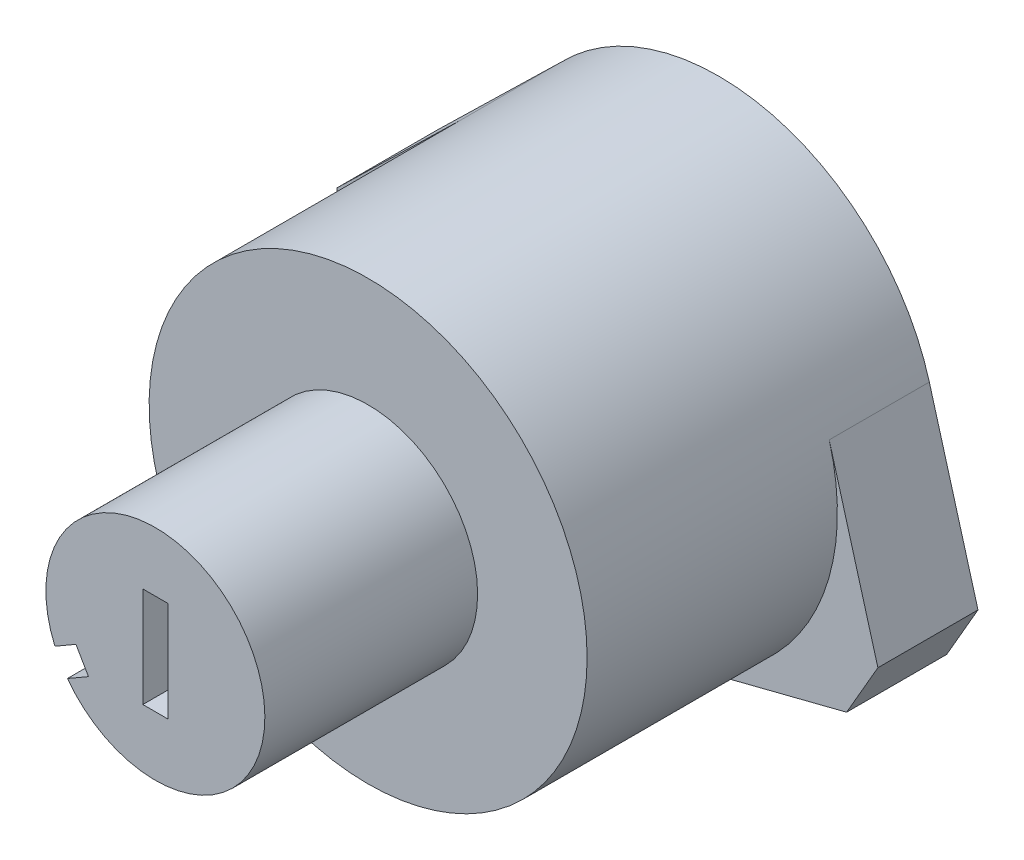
ISO-10303-21;
HEADER;
FILE_DESCRIPTION(('STEP AP214'),'2;1');
FILE_NAME('part.step','',(''),(''),'','','');
FILE_SCHEMA(('AUTOMOTIVE_DESIGN { 1 0 10303 214 1 1 1 1 }'));
ENDSEC;
DATA;
#1=APPLICATION_CONTEXT('core data for automotive mechanical design processes');
#2=APPLICATION_PROTOCOL_DEFINITION('international standard','automotive_design',2000,#1);
#3=PRODUCT_CONTEXT('',#1,'mechanical');
#4=PRODUCT('Part','Part','',(#3));
#5=PRODUCT_RELATED_PRODUCT_CATEGORY('part','',(#4));
#6=PRODUCT_DEFINITION_FORMATION('','',#4);
#7=PRODUCT_DEFINITION_CONTEXT('part definition',#1,'design');
#8=PRODUCT_DEFINITION('design','',#6,#7);
#9=PRODUCT_DEFINITION_SHAPE('','',#8);
#10=(LENGTH_UNIT() NAMED_UNIT(*) SI_UNIT(.MILLI.,.METRE.));
#11=(NAMED_UNIT(*) PLANE_ANGLE_UNIT() SI_UNIT($,.RADIAN.));
#12=(NAMED_UNIT(*) SI_UNIT($,.STERADIAN.) SOLID_ANGLE_UNIT());
#13=UNCERTAINTY_MEASURE_WITH_UNIT(LENGTH_MEASURE(1.E-05),#10,'distance_accuracy_value','');
#14=(GEOMETRIC_REPRESENTATION_CONTEXT(3) GLOBAL_UNCERTAINTY_ASSIGNED_CONTEXT((#13)) GLOBAL_UNIT_ASSIGNED_CONTEXT((#10,
#11,#12)) REPRESENTATION_CONTEXT('',''));
#15=CARTESIAN_POINT('',(0.,0.,0.));
#16=DIRECTION('',(0.,0.,1.));
#17=DIRECTION('',(1.,0.,0.));
#18=AXIS2_PLACEMENT_3D('',#15,#16,#17);
#19=CARTESIAN_POINT('',(0.,0.,10.16));
#20=DIRECTION('',(0.,0.,1.));
#21=DIRECTION('',(1.,0.,0.));
#22=AXIS2_PLACEMENT_3D('',#19,#20,#21);
#23=PLANE('',#22);
#24=CARTESIAN_POINT('',(0.,0.,10.16));
#25=DIRECTION('',(0.,0.,1.));
#26=DIRECTION('',(1.,0.,0.));
#27=AXIS2_PLACEMENT_3D('',#24,#25,#26);
#28=CIRCLE('',#27,22.225);
#29=CARTESIAN_POINT('',(-15.9871593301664,15.4389559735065,10.16));
#30=VERTEX_POINT('',#29);
#31=CARTESIAN_POINT('',(-17.0418117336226,-14.2662986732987,10.16));
#32=VERTEX_POINT('',#31);
#33=EDGE_CURVE('E11',#30,#32,#28,.T.);
#34=ORIENTED_EDGE('',*,*,#33,.F.);
#35=DIRECTION('',(-0.716261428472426,-0.697832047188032,0.));
#36=VECTOR('',#35,1.);
#37=CARTESIAN_POINT('',(-28.575,3.175,10.16));
#38=LINE('',#37,#36);
#39=CARTESIAN_POINT('',(-28.575,3.175,10.16));
#40=VERTEX_POINT('',#39);
#41=EDGE_CURVE('E232',#30,#40,#38,.T.);
#42=ORIENTED_EDGE('',*,*,#41,.T.);
#43=DIRECTION('',(0.,-1.,0.));
#44=VECTOR('',#43,1.);
#45=CARTESIAN_POINT('',(-28.575,-3.175,10.16));
#46=LINE('',#45,#44);
#47=CARTESIAN_POINT('',(-28.575,-3.175,10.16));
#48=VERTEX_POINT('',#47);
#49=EDGE_CURVE('E235',#40,#48,#46,.T.);
#50=ORIENTED_EDGE('',*,*,#49,.T.);
#51=DIRECTION('',(0.720780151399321,-0.693163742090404,0.));
#52=VECTOR('',#51,1.);
#53=CARTESIAN_POINT('',(-28.575,-3.175,10.16));
#54=LINE('',#53,#52);
#55=EDGE_CURVE('E238',#48,#32,#54,.T.);
#56=ORIENTED_EDGE('',*,*,#55,.T.);
#57=EDGE_LOOP('',(#34,#42,#50,#56));
#58=FACE_BOUND('',#57,.T.);
#59=ADVANCED_FACE('F45',(#58),#23,.T.);
#60=CARTESIAN_POINT('',(-28.575,3.175,10.16));
#61=DIRECTION('',(0.697832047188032,-0.716261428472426,0.));
#62=DIRECTION('',(0.716261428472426,0.697832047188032,0.));
#63=AXIS2_PLACEMENT_3D('',#60,#61,#62);
#64=PLANE('',#63);
#65=DIRECTION('',(-0.716261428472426,-0.697832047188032,0.));
#66=VECTOR('',#65,1.);
#67=CARTESIAN_POINT('',(-28.575,3.175,0.));
#68=LINE('',#67,#66);
#69=CARTESIAN_POINT('',(-15.9871593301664,15.4389559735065,0.));
#70=VERTEX_POINT('',#69);
#71=CARTESIAN_POINT('',(-28.575,3.175,0.));
#72=VERTEX_POINT('',#71);
#73=EDGE_CURVE('E230',#70,#72,#68,.T.);
#74=ORIENTED_EDGE('',*,*,#73,.T.);
#75=DIRECTION('',(0.,0.,-1.));
#76=VECTOR('',#75,1.);
#77=CARTESIAN_POINT('',(-28.575,3.175,10.16));
#78=LINE('',#77,#76);
#79=EDGE_CURVE('E49',#40,#72,#78,.T.);
#80=ORIENTED_EDGE('',*,*,#79,.F.);
#81=ORIENTED_EDGE('',*,*,#41,.F.);
#82=DIRECTION('',(0.,0.,-1.));
#83=VECTOR('',#82,1.);
#84=CARTESIAN_POINT('',(-15.9871593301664,15.4389559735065,10.16));
#85=LINE('',#84,#83);
#86=EDGE_CURVE('E247',#30,#70,#85,.T.);
#87=ORIENTED_EDGE('',*,*,#86,.T.);
#88=EDGE_LOOP('',(#74,#80,#81,#87));
#89=FACE_BOUND('',#88,.T.);
#90=ADVANCED_FACE('F47',(#89),#64,.F.);
#91=CARTESIAN_POINT('',(-28.575,-3.175,10.16));
#92=DIRECTION('',(1.,0.,0.));
#93=DIRECTION('',(0.,0.,-1.));
#94=AXIS2_PLACEMENT_3D('',#91,#92,#93);
#95=PLANE('',#94);
#96=DIRECTION('',(0.,-1.,0.));
#97=VECTOR('',#96,1.);
#98=CARTESIAN_POINT('',(-28.575,-3.175,0.));
#99=LINE('',#98,#97);
#100=CARTESIAN_POINT('',(-28.575,-3.175,0.));
#101=VERTEX_POINT('',#100);
#102=EDGE_CURVE('E250',#72,#101,#99,.T.);
#103=ORIENTED_EDGE('',*,*,#102,.T.);
#104=DIRECTION('',(0.,0.,-1.));
#105=VECTOR('',#104,1.);
#106=CARTESIAN_POINT('',(-28.575,-3.175,10.16));
#107=LINE('',#106,#105);
#108=EDGE_CURVE('E279',#48,#101,#107,.T.);
#109=ORIENTED_EDGE('',*,*,#108,.F.);
#110=ORIENTED_EDGE('',*,*,#49,.F.);
#111=ORIENTED_EDGE('',*,*,#79,.T.);
#112=EDGE_LOOP('',(#103,#109,#110,#111));
#113=FACE_BOUND('',#112,.T.);
#114=ADVANCED_FACE('F335',(#113),#95,.F.);
#115=CARTESIAN_POINT('',(-28.575,-3.175,10.16));
#116=DIRECTION('',(0.693163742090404,0.720780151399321,0.));
#117=DIRECTION('',(-0.720780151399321,0.693163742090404,0.));
#118=AXIS2_PLACEMENT_3D('',#115,#116,#117);
#119=PLANE('',#118);
#120=DIRECTION('',(0.720780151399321,-0.693163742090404,0.));
#121=VECTOR('',#120,1.);
#122=CARTESIAN_POINT('',(-28.575,-3.175,0.));
#123=LINE('',#122,#121);
#124=CARTESIAN_POINT('',(-17.0418117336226,-14.2662986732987,0.));
#125=VERTEX_POINT('',#124);
#126=EDGE_CURVE('E252',#101,#125,#123,.T.);
#127=ORIENTED_EDGE('',*,*,#126,.T.);
#128=DIRECTION('',(0.,0.,-1.));
#129=VECTOR('',#128,1.);
#130=CARTESIAN_POINT('',(-17.0418117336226,-14.2662986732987,10.16));
#131=LINE('',#130,#129);
#132=EDGE_CURVE('E277',#32,#125,#131,.T.);
#133=ORIENTED_EDGE('',*,*,#132,.F.);
#134=ORIENTED_EDGE('',*,*,#55,.F.);
#135=ORIENTED_EDGE('',*,*,#108,.T.);
#136=EDGE_LOOP('',(#127,#133,#134,#135));
#137=FACE_BOUND('',#136,.T.);
#138=ADVANCED_FACE('F327',(#137),#119,.F.);
#139=CARTESIAN_POINT('',(23.1591759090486,-17.0371306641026,10.16));
#140=DIRECTION('',(-0.246757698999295,0.969077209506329,0.));
#141=DIRECTION('',(-0.969077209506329,-0.246757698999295,0.));
#142=AXIS2_PLACEMENT_3D('',#139,#140,#141);
#143=PLANE('',#142);
#144=DIRECTION('',(0.969077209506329,0.246757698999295,0.));
#145=VECTOR('',#144,1.);
#146=CARTESIAN_POINT('',(23.1591759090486,-17.0371306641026,0.));
#147=LINE('',#146,#145);
#148=CARTESIAN_POINT('',(5.48418986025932,-21.5377409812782,0.));
#149=VERTEX_POINT('',#148);
#150=CARTESIAN_POINT('',(23.1591759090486,-17.0371306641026,0.));
#151=VERTEX_POINT('',#150);
#152=EDGE_CURVE('E256',#149,#151,#147,.T.);
#153=ORIENTED_EDGE('',*,*,#152,.T.);
#154=DIRECTION('',(0.,0.,-1.));
#155=VECTOR('',#154,1.);
#156=CARTESIAN_POINT('',(23.1591759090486,-17.0371306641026,10.16));
#157=LINE('',#156,#155);
#158=CARTESIAN_POINT('',(23.1591759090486,-17.0371306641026,10.16));
#159=VERTEX_POINT('',#158);
#160=EDGE_CURVE('E271',#159,#151,#157,.T.);
#161=ORIENTED_EDGE('',*,*,#160,.F.);
#162=DIRECTION('',(0.969077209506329,0.246757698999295,0.));
#163=VECTOR('',#162,1.);
#164=CARTESIAN_POINT('',(23.1591759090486,-17.0371306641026,10.16));
#165=LINE('',#164,#163);
#166=CARTESIAN_POINT('',(5.48418986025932,-21.5377409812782,10.16));
#167=VERTEX_POINT('',#166);
#168=EDGE_CURVE('E240',#167,#159,#165,.T.);
#169=ORIENTED_EDGE('',*,*,#168,.F.);
#170=DIRECTION('',(0.,0.,-1.));
#171=VECTOR('',#170,1.);
#172=CARTESIAN_POINT('',(5.48418986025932,-21.5377409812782,10.16));
#173=LINE('',#172,#171);
#174=EDGE_CURVE('E274',#167,#149,#173,.T.);
#175=ORIENTED_EDGE('',*,*,#174,.T.);
#176=EDGE_LOOP('',(#153,#161,#169,#175));
#177=FACE_BOUND('',#176,.T.);
#178=ADVANCED_FACE('F316',(#177),#143,.F.);
#179=CARTESIAN_POINT('',(23.1591759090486,-17.0371306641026,10.16));
#180=DIRECTION('',(-0.866025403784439,0.5,0.));
#181=DIRECTION('',(-0.5,-0.866025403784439,0.));
#182=AXIS2_PLACEMENT_3D('',#179,#180,#181);
#183=PLANE('',#182);
#184=DIRECTION('',(0.5,0.866025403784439,0.));
#185=VECTOR('',#184,1.);
#186=CARTESIAN_POINT('',(23.1591759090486,-17.0371306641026,0.));
#187=LINE('',#186,#185);
#188=CARTESIAN_POINT('',(26.334175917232,-11.5378693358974,0.));
#189=VERTEX_POINT('',#188);
#190=EDGE_CURVE('E258',#151,#189,#187,.T.);
#191=ORIENTED_EDGE('',*,*,#190,.T.);
#192=DIRECTION('',(0.,0.,-1.));
#193=VECTOR('',#192,1.);
#194=CARTESIAN_POINT('',(26.334175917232,-11.5378693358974,10.16));
#195=LINE('',#194,#193);
#196=CARTESIAN_POINT('',(26.334175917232,-11.5378693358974,10.16));
#197=VERTEX_POINT('',#196);
#198=EDGE_CURVE('E268',#197,#189,#195,.T.);
#199=ORIENTED_EDGE('',*,*,#198,.F.);
#200=DIRECTION('',(0.5,0.866025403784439,0.));
#201=VECTOR('',#200,1.);
#202=CARTESIAN_POINT('',(23.1591759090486,-17.0371306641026,10.16));
#203=LINE('',#202,#201);
#204=EDGE_CURVE('E242',#159,#197,#203,.T.);
#205=ORIENTED_EDGE('',*,*,#204,.F.);
#206=ORIENTED_EDGE('',*,*,#160,.T.);
#207=EDGE_LOOP('',(#191,#199,#205,#206));
#208=FACE_BOUND('',#207,.T.);
#209=ADVANCED_FACE('F318',(#208),#183,.F.);
#210=CARTESIAN_POINT('',(26.334175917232,-11.5378693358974,10.16));
#211=DIRECTION('',(-0.962624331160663,-0.270840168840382,0.));
#212=DIRECTION('',(0.270840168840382,-0.962624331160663,0.));
#213=AXIS2_PLACEMENT_3D('',#210,#211,#212);
#214=PLANE('',#213);
#215=DIRECTION('',(-0.270840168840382,0.962624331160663,0.));
#216=VECTOR('',#215,1.);
#217=CARTESIAN_POINT('',(26.334175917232,-11.5378693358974,0.));
#218=LINE('',#217,#216);
#219=CARTESIAN_POINT('',(21.3943257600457,6.01942275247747,0.));
#220=VERTEX_POINT('',#219);
#221=EDGE_CURVE('E260',#189,#220,#218,.T.);
#222=ORIENTED_EDGE('',*,*,#221,.T.);
#223=DIRECTION('',(0.,0.,-1.));
#224=VECTOR('',#223,1.);
#225=CARTESIAN_POINT('',(21.3943257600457,6.01942275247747,10.16));
#226=LINE('',#225,#224);
#227=CARTESIAN_POINT('',(21.3943257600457,6.01942275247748,10.16));
#228=VERTEX_POINT('',#227);
#229=EDGE_CURVE('E265',#228,#220,#226,.T.);
#230=ORIENTED_EDGE('',*,*,#229,.F.);
#231=DIRECTION('',(-0.270840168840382,0.962624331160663,0.));
#232=VECTOR('',#231,1.);
#233=CARTESIAN_POINT('',(26.334175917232,-11.5378693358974,10.16));
#234=LINE('',#233,#232);
#235=EDGE_CURVE('E244',#197,#228,#234,.T.);
#236=ORIENTED_EDGE('',*,*,#235,.F.);
#237=ORIENTED_EDGE('',*,*,#198,.T.);
#238=EDGE_LOOP('',(#222,#230,#236,#237));
#239=FACE_BOUND('',#238,.T.);
#240=ADVANCED_FACE('F302',(#239),#214,.F.);
#241=CARTESIAN_POINT('',(0.,0.,10.16));
#242=DIRECTION('',(0.,0.,-1.));
#243=DIRECTION('',(-1.,0.,0.));
#244=AXIS2_PLACEMENT_3D('',#241,#242,#243);
#245=CYLINDRICAL_SURFACE('',#244,22.225);
#246=CARTESIAN_POINT('',(0.,0.,0.));
#247=DIRECTION('',(0.,0.,1.));
#248=DIRECTION('',(1.,0.,0.));
#249=AXIS2_PLACEMENT_3D('',#246,#247,#248);
#250=CIRCLE('',#249,22.225);
#251=EDGE_CURVE('E236',#220,#70,#250,.T.);
#252=ORIENTED_EDGE('',*,*,#251,.T.);
#253=ORIENTED_EDGE('',*,*,#86,.F.);
#254=ORIENTED_EDGE('',*,*,#33,.T.);
#255=ORIENTED_EDGE('',*,*,#132,.T.);
#256=CARTESIAN_POINT('',(0.,0.,0.));
#257=DIRECTION('',(0.,0.,1.));
#258=DIRECTION('',(1.,0.,0.));
#259=AXIS2_PLACEMENT_3D('',#256,#257,#258);
#260=CIRCLE('',#259,22.225);
#261=EDGE_CURVE('E254',#125,#149,#260,.T.);
#262=ORIENTED_EDGE('',*,*,#261,.T.);
#263=ORIENTED_EDGE('',*,*,#174,.F.);
#264=EDGE_CURVE('E54',#167,#228,#28,.T.);
#265=ORIENTED_EDGE('',*,*,#264,.T.);
#266=ORIENTED_EDGE('',*,*,#229,.T.);
#267=EDGE_LOOP('',(#252,#253,#254,#255,#262,#263,#265,#266));
#268=FACE_BOUND('',#267,.T.);
#269=CARTESIAN_POINT('',(0.,0.,35.56));
#270=DIRECTION('',(0.,0.,1.));
#271=DIRECTION('',(1.,0.,0.));
#272=AXIS2_PLACEMENT_3D('',#269,#270,#271);
#273=CIRCLE('',#272,22.225);
#274=CARTESIAN_POINT('',(22.225,0.,35.56));
#275=VERTEX_POINT('',#274);
#276=EDGE_CURVE('E228',#275,#275,#273,.T.);
#277=ORIENTED_EDGE('',*,*,#276,.F.);
#278=EDGE_LOOP('',(#277));
#279=FACE_BOUND('',#278,.T.);
#280=ADVANCED_FACE('F291',(#268,#279),#245,.T.);
#281=ORIENTED_EDGE('',*,*,#264,.F.);
#282=ORIENTED_EDGE('',*,*,#168,.T.);
#283=ORIENTED_EDGE('',*,*,#204,.T.);
#284=ORIENTED_EDGE('',*,*,#235,.T.);
#285=EDGE_LOOP('',(#281,#282,#283,#284));
#286=FACE_BOUND('',#285,.T.);
#287=ADVANCED_FACE('F296',(#286),#23,.T.);
#288=CARTESIAN_POINT('',(0.,0.,0.));
#289=DIRECTION('',(0.,0.,1.));
#290=DIRECTION('',(1.,0.,0.));
#291=AXIS2_PLACEMENT_3D('',#288,#289,#290);
#292=PLANE('',#291);
#293=ORIENTED_EDGE('',*,*,#73,.F.);
#294=ORIENTED_EDGE('',*,*,#251,.F.);
#295=ORIENTED_EDGE('',*,*,#221,.F.);
#296=ORIENTED_EDGE('',*,*,#190,.F.);
#297=ORIENTED_EDGE('',*,*,#152,.F.);
#298=ORIENTED_EDGE('',*,*,#261,.F.);
#299=ORIENTED_EDGE('',*,*,#126,.F.);
#300=ORIENTED_EDGE('',*,*,#102,.F.);
#301=EDGE_LOOP('',(#293,#294,#295,#296,#297,#298,#299,#300));
#302=FACE_BOUND('',#301,.T.);
#303=ADVANCED_FACE('F307',(#302),#292,.F.);
#304=CARTESIAN_POINT('',(0.,0.,35.56));
#305=DIRECTION('',(0.,0.,1.));
#306=DIRECTION('',(1.,0.,0.));
#307=AXIS2_PLACEMENT_3D('',#304,#305,#306);
#308=PLANE('',#307);
#309=CARTESIAN_POINT('',(0.,0.,35.56));
#310=DIRECTION('',(0.,0.,1.));
#311=DIRECTION('',(1.,0.,0.));
#312=AXIS2_PLACEMENT_3D('',#309,#310,#311);
#313=CIRCLE('',#312,11.1125);
#314=CARTESIAN_POINT('',(-8.9256520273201,-6.61969728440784,35.56));
#315=VERTEX_POINT('',#314);
#316=CARTESIAN_POINT('',(-10.1956520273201,-4.41999275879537,35.56));
#317=VERTEX_POINT('',#316);
#318=EDGE_CURVE('E70',#315,#317,#313,.T.);
#319=ORIENTED_EDGE('',*,*,#318,.F.);
#320=DIRECTION('',(-0.866025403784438,-0.500000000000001,0.));
#321=VECTOR('',#320,1.);
#322=CARTESIAN_POINT('',(-8.9256520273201,-6.61969728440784,35.56));
#323=LINE('',#322,#321);
#324=CARTESIAN_POINT('',(-6.7890027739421,-5.38610226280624,35.56));
#325=VERTEX_POINT('',#324);
#326=EDGE_CURVE('E202',#325,#315,#323,.T.);
#327=ORIENTED_EDGE('',*,*,#326,.F.);
#328=DIRECTION('',(0.5,-0.866025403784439,0.));
#329=VECTOR('',#328,1.);
#330=CARTESIAN_POINT('',(-8.0590027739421,-3.18639773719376,35.56));
#331=LINE('',#330,#329);
#332=CARTESIAN_POINT('',(-8.0590027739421,-3.18639773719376,35.56));
#333=VERTEX_POINT('',#332);
#334=EDGE_CURVE('E213',#333,#325,#331,.T.);
#335=ORIENTED_EDGE('',*,*,#334,.F.);
#336=DIRECTION('',(0.866025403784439,0.5,0.));
#337=VECTOR('',#336,1.);
#338=CARTESIAN_POINT('',(-10.1956520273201,-4.41999275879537,35.56));
#339=LINE('',#338,#337);
#340=EDGE_CURVE('E210',#317,#333,#339,.T.);
#341=ORIENTED_EDGE('',*,*,#340,.F.);
#342=EDGE_LOOP('',(#319,#327,#335,#341));
#343=FACE_BOUND('',#342,.T.);
#344=ORIENTED_EDGE('',*,*,#276,.T.);
#345=EDGE_LOOP('',(#344));
#346=FACE_BOUND('',#345,.T.);
#347=ADVANCED_FACE('F343',(#343,#346),#308,.T.);
#348=CARTESIAN_POINT('',(0.,0.,57.15));
#349=DIRECTION('',(0.,0.,-1.));
#350=DIRECTION('',(-1.,0.,0.));
#351=AXIS2_PLACEMENT_3D('',#348,#349,#350);
#352=CYLINDRICAL_SURFACE('',#351,11.1125);
#353=ORIENTED_EDGE('',*,*,#318,.T.);
#354=DIRECTION('',(0.,0.,-1.));
#355=VECTOR('',#354,1.);
#356=CARTESIAN_POINT('',(-10.1956520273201,-4.41999275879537,57.15));
#357=LINE('',#356,#355);
#358=CARTESIAN_POINT('',(-10.1956520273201,-4.41999275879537,57.15));
#359=VERTEX_POINT('',#358);
#360=EDGE_CURVE('E225',#359,#317,#357,.T.);
#361=ORIENTED_EDGE('',*,*,#360,.F.);
#362=CARTESIAN_POINT('',(0.,0.,57.15));
#363=DIRECTION('',(0.,0.,1.));
#364=DIRECTION('',(1.,0.,0.));
#365=AXIS2_PLACEMENT_3D('',#362,#363,#364);
#366=CIRCLE('',#365,11.1125);
#367=CARTESIAN_POINT('',(-8.9256520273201,-6.61969728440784,57.15));
#368=VERTEX_POINT('',#367);
#369=EDGE_CURVE('E198',#368,#359,#366,.T.);
#370=ORIENTED_EDGE('',*,*,#369,.F.);
#371=DIRECTION('',(0.,0.,-1.));
#372=VECTOR('',#371,1.);
#373=CARTESIAN_POINT('',(-8.9256520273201,-6.61969728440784,57.15));
#374=LINE('',#373,#372);
#375=EDGE_CURVE('E208',#368,#315,#374,.T.);
#376=ORIENTED_EDGE('',*,*,#375,.T.);
#377=EDGE_LOOP('',(#353,#361,#370,#376));
#378=FACE_BOUND('',#377,.T.);
#379=ADVANCED_FACE('F407',(#378),#352,.T.);
#380=CARTESIAN_POINT('',(-10.1956520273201,-4.41999275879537,57.15));
#381=DIRECTION('',(-0.5,0.866025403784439,0.));
#382=DIRECTION('',(-0.866025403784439,-0.5,0.));
#383=AXIS2_PLACEMENT_3D('',#380,#381,#382);
#384=PLANE('',#383);
#385=ORIENTED_EDGE('',*,*,#340,.T.);
#386=DIRECTION('',(0.,0.,-1.));
#387=VECTOR('',#386,1.);
#388=CARTESIAN_POINT('',(-8.0590027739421,-3.18639773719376,57.15));
#389=LINE('',#388,#387);
#390=CARTESIAN_POINT('',(-8.0590027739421,-3.18639773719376,57.15));
#391=VERTEX_POINT('',#390);
#392=EDGE_CURVE('E222',#391,#333,#389,.T.);
#393=ORIENTED_EDGE('',*,*,#392,.F.);
#394=DIRECTION('',(0.866025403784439,0.5,0.));
#395=VECTOR('',#394,1.);
#396=CARTESIAN_POINT('',(-10.1956520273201,-4.41999275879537,57.15));
#397=LINE('',#396,#395);
#398=EDGE_CURVE('E201',#359,#391,#397,.T.);
#399=ORIENTED_EDGE('',*,*,#398,.F.);
#400=ORIENTED_EDGE('',*,*,#360,.T.);
#401=EDGE_LOOP('',(#385,#393,#399,#400));
#402=FACE_BOUND('',#401,.T.);
#403=ADVANCED_FACE('F414',(#402),#384,.F.);
#404=CARTESIAN_POINT('',(-8.0590027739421,-3.18639773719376,57.15));
#405=DIRECTION('',(0.866025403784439,0.5,0.));
#406=DIRECTION('',(-0.5,0.866025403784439,0.));
#407=AXIS2_PLACEMENT_3D('',#404,#405,#406);
#408=PLANE('',#407);
#409=ORIENTED_EDGE('',*,*,#334,.T.);
#410=DIRECTION('',(0.,0.,-1.));
#411=VECTOR('',#410,1.);
#412=CARTESIAN_POINT('',(-6.7890027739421,-5.38610226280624,57.15));
#413=LINE('',#412,#411);
#414=CARTESIAN_POINT('',(-6.7890027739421,-5.38610226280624,57.15));
#415=VERTEX_POINT('',#414);
#416=EDGE_CURVE('E219',#415,#325,#413,.T.);
#417=ORIENTED_EDGE('',*,*,#416,.F.);
#418=DIRECTION('',(0.5,-0.866025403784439,0.));
#419=VECTOR('',#418,1.);
#420=CARTESIAN_POINT('',(-8.0590027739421,-3.18639773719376,57.15));
#421=LINE('',#420,#419);
#422=EDGE_CURVE('E204',#391,#415,#421,.T.);
#423=ORIENTED_EDGE('',*,*,#422,.F.);
#424=ORIENTED_EDGE('',*,*,#392,.T.);
#425=EDGE_LOOP('',(#409,#417,#423,#424));
#426=FACE_BOUND('',#425,.T.);
#427=ADVANCED_FACE('F423',(#426),#408,.F.);
#428=CARTESIAN_POINT('',(-8.9256520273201,-6.61969728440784,57.15));
#429=DIRECTION('',(0.500000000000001,-0.866025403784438,0.));
#430=DIRECTION('',(0.866025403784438,0.500000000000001,0.));
#431=AXIS2_PLACEMENT_3D('',#428,#429,#430);
#432=PLANE('',#431);
#433=ORIENTED_EDGE('',*,*,#326,.T.);
#434=ORIENTED_EDGE('',*,*,#375,.F.);
#435=DIRECTION('',(-0.866025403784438,-0.500000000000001,0.));
#436=VECTOR('',#435,1.);
#437=CARTESIAN_POINT('',(-8.9256520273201,-6.61969728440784,57.15));
#438=LINE('',#437,#436);
#439=EDGE_CURVE('E206',#415,#368,#438,.T.);
#440=ORIENTED_EDGE('',*,*,#439,.F.);
#441=ORIENTED_EDGE('',*,*,#416,.T.);
#442=EDGE_LOOP('',(#433,#434,#440,#441));
#443=FACE_BOUND('',#442,.T.);
#444=ADVANCED_FACE('F432',(#443),#432,.F.);
#445=CARTESIAN_POINT('',(0.,0.,57.15));
#446=DIRECTION('',(0.,0.,1.));
#447=DIRECTION('',(1.,0.,0.));
#448=AXIS2_PLACEMENT_3D('',#445,#446,#447);
#449=PLANE('',#448);
#450=DIRECTION('',(0.,-1.,0.));
#451=VECTOR('',#450,1.);
#452=CARTESIAN_POINT('',(-1.27,-5.08,57.15));
#453=LINE('',#452,#451);
#454=CARTESIAN_POINT('',(-1.27,5.08,57.15));
#455=VERTEX_POINT('',#454);
#456=CARTESIAN_POINT('',(-1.27,-5.08,57.15));
#457=VERTEX_POINT('',#456);
#458=EDGE_CURVE('E62',#455,#457,#453,.T.);
#459=ORIENTED_EDGE('',*,*,#458,.F.);
#460=DIRECTION('',(-1.,0.,0.));
#461=VECTOR('',#460,1.);
#462=CARTESIAN_POINT('',(1.27,5.08,57.15));
#463=LINE('',#462,#461);
#464=CARTESIAN_POINT('',(1.27,5.08,57.15));
#465=VERTEX_POINT('',#464);
#466=EDGE_CURVE('E180',#465,#455,#463,.T.);
#467=ORIENTED_EDGE('',*,*,#466,.F.);
#468=DIRECTION('',(0.,1.,0.));
#469=VECTOR('',#468,1.);
#470=CARTESIAN_POINT('',(1.27,-5.08,57.15));
#471=LINE('',#470,#469);
#472=CARTESIAN_POINT('',(1.27,-5.08,57.15));
#473=VERTEX_POINT('',#472);
#474=EDGE_CURVE('E183',#473,#465,#471,.T.);
#475=ORIENTED_EDGE('',*,*,#474,.F.);
#476=DIRECTION('',(1.,0.,0.));
#477=VECTOR('',#476,1.);
#478=CARTESIAN_POINT('',(1.27,-5.08,57.15));
#479=LINE('',#478,#477);
#480=EDGE_CURVE('E189',#457,#473,#479,.T.);
#481=ORIENTED_EDGE('',*,*,#480,.F.);
#482=EDGE_LOOP('',(#459,#467,#475,#481));
#483=FACE_BOUND('',#482,.T.);
#484=ORIENTED_EDGE('',*,*,#369,.T.);
#485=ORIENTED_EDGE('',*,*,#398,.T.);
#486=ORIENTED_EDGE('',*,*,#422,.T.);
#487=ORIENTED_EDGE('',*,*,#439,.T.);
#488=EDGE_LOOP('',(#484,#485,#486,#487));
#489=FACE_BOUND('',#488,.T.);
#490=ADVANCED_FACE('F441',(#483,#489),#449,.T.);
#491=CARTESIAN_POINT('',(-1.27,-5.08,54.61));
#492=DIRECTION('',(-1.,0.,0.));
#493=DIRECTION('',(0.,0.,1.));
#494=AXIS2_PLACEMENT_3D('',#491,#492,#493);
#495=PLANE('',#494);
#496=ORIENTED_EDGE('',*,*,#458,.T.);
#497=DIRECTION('',(0.,0.,1.));
#498=VECTOR('',#497,1.);
#499=CARTESIAN_POINT('',(-1.27,-5.08,54.61));
#500=LINE('',#499,#498);
#501=CARTESIAN_POINT('',(-1.27,-5.08,54.61));
#502=VERTEX_POINT('',#501);
#503=EDGE_CURVE('E158',#502,#457,#500,.T.);
#504=ORIENTED_EDGE('',*,*,#503,.F.);
#505=DIRECTION('',(0.,-1.,0.));
#506=VECTOR('',#505,1.);
#507=CARTESIAN_POINT('',(-1.27,-5.08,54.61));
#508=LINE('',#507,#506);
#509=CARTESIAN_POINT('',(-1.27,5.08,54.61));
#510=VERTEX_POINT('',#509);
#511=EDGE_CURVE('E162',#510,#502,#508,.T.);
#512=ORIENTED_EDGE('',*,*,#511,.F.);
#513=DIRECTION('',(0.,0.,1.));
#514=VECTOR('',#513,1.);
#515=CARTESIAN_POINT('',(-1.27,5.08,54.61));
#516=LINE('',#515,#514);
#517=EDGE_CURVE('E193',#510,#455,#516,.T.);
#518=ORIENTED_EDGE('',*,*,#517,.T.);
#519=EDGE_LOOP('',(#496,#504,#512,#518));
#520=FACE_BOUND('',#519,.T.);
#521=ADVANCED_FACE('F160',(#520),#495,.F.);
#522=CARTESIAN_POINT('',(1.27,5.08,54.61));
#523=DIRECTION('',(0.,1.,0.));
#524=DIRECTION('',(0.,0.,1.));
#525=AXIS2_PLACEMENT_3D('',#522,#523,#524);
#526=PLANE('',#525);
#527=ORIENTED_EDGE('',*,*,#466,.T.);
#528=ORIENTED_EDGE('',*,*,#517,.F.);
#529=DIRECTION('',(-1.,0.,0.));
#530=VECTOR('',#529,1.);
#531=CARTESIAN_POINT('',(1.27,5.08,54.61));
#532=LINE('',#531,#530);
#533=CARTESIAN_POINT('',(1.27,5.08,54.61));
#534=VERTEX_POINT('',#533);
#535=EDGE_CURVE('E168',#534,#510,#532,.T.);
#536=ORIENTED_EDGE('',*,*,#535,.F.);
#537=DIRECTION('',(0.,0.,1.));
#538=VECTOR('',#537,1.);
#539=CARTESIAN_POINT('',(1.27,5.08,54.61));
#540=LINE('',#539,#538);
#541=EDGE_CURVE('E195',#534,#465,#540,.T.);
#542=ORIENTED_EDGE('',*,*,#541,.T.);
#543=EDGE_LOOP('',(#527,#528,#536,#542));
#544=FACE_BOUND('',#543,.T.);
#545=ADVANCED_FACE('F459',(#544),#526,.F.);
#546=CARTESIAN_POINT('',(1.27,-5.08,54.61));
#547=DIRECTION('',(1.,0.,0.));
#548=DIRECTION('',(0.,0.,-1.));
#549=AXIS2_PLACEMENT_3D('',#546,#547,#548);
#550=PLANE('',#549);
#551=ORIENTED_EDGE('',*,*,#474,.T.);
#552=ORIENTED_EDGE('',*,*,#541,.F.);
#553=DIRECTION('',(0.,1.,0.));
#554=VECTOR('',#553,1.);
#555=CARTESIAN_POINT('',(1.27,-5.08,54.61));
#556=LINE('',#555,#554);
#557=CARTESIAN_POINT('',(1.27,-5.08,54.61));
#558=VERTEX_POINT('',#557);
#559=EDGE_CURVE('E176',#558,#534,#556,.T.);
#560=ORIENTED_EDGE('',*,*,#559,.F.);
#561=DIRECTION('',(0.,0.,1.));
#562=VECTOR('',#561,1.);
#563=CARTESIAN_POINT('',(1.27,-5.08,54.61));
#564=LINE('',#563,#562);
#565=EDGE_CURVE('E167',#558,#473,#564,.T.);
#566=ORIENTED_EDGE('',*,*,#565,.T.);
#567=EDGE_LOOP('',(#551,#552,#560,#566));
#568=FACE_BOUND('',#567,.T.);
#569=ADVANCED_FACE('F467',(#568),#550,.F.);
#570=CARTESIAN_POINT('',(1.27,-5.08,54.61));
#571=DIRECTION('',(0.,-1.,0.));
#572=DIRECTION('',(0.,0.,-1.));
#573=AXIS2_PLACEMENT_3D('',#570,#571,#572);
#574=PLANE('',#573);
#575=ORIENTED_EDGE('',*,*,#480,.T.);
#576=ORIENTED_EDGE('',*,*,#565,.F.);
#577=DIRECTION('',(1.,0.,0.));
#578=VECTOR('',#577,1.);
#579=CARTESIAN_POINT('',(1.27,-5.08,54.61));
#580=LINE('',#579,#578);
#581=EDGE_CURVE('E171',#502,#558,#580,.T.);
#582=ORIENTED_EDGE('',*,*,#581,.F.);
#583=ORIENTED_EDGE('',*,*,#503,.T.);
#584=EDGE_LOOP('',(#575,#576,#582,#583));
#585=FACE_BOUND('',#584,.T.);
#586=ADVANCED_FACE('F172',(#585),#574,.F.);
#587=CARTESIAN_POINT('',(0.,0.,54.61));
#588=DIRECTION('',(0.,0.,1.));
#589=DIRECTION('',(1.,0.,0.));
#590=AXIS2_PLACEMENT_3D('',#587,#588,#589);
#591=PLANE('',#590);
#592=ORIENTED_EDGE('',*,*,#511,.T.);
#593=ORIENTED_EDGE('',*,*,#581,.T.);
#594=ORIENTED_EDGE('',*,*,#559,.T.);
#595=ORIENTED_EDGE('',*,*,#535,.T.);
#596=EDGE_LOOP('',(#592,#593,#594,#595));
#597=FACE_BOUND('',#596,.T.);
#598=ADVANCED_FACE('F178',(#597),#591,.T.);
#599=CLOSED_SHELL('',(#59,#90,#114,#138,#178,#209,#240,#280,#287,#303,#347,#379,#403,#427,#444,
#490,#521,#545,#569,#586,#598));
#600=MANIFOLD_SOLID_BREP('B2',#599);
#601=ADVANCED_BREP_SHAPE_REPRESENTATION('',(#18,#600),#14);
#602=SHAPE_DEFINITION_REPRESENTATION(#9,#601);
ENDSEC;
END-ISO-10303-21;
